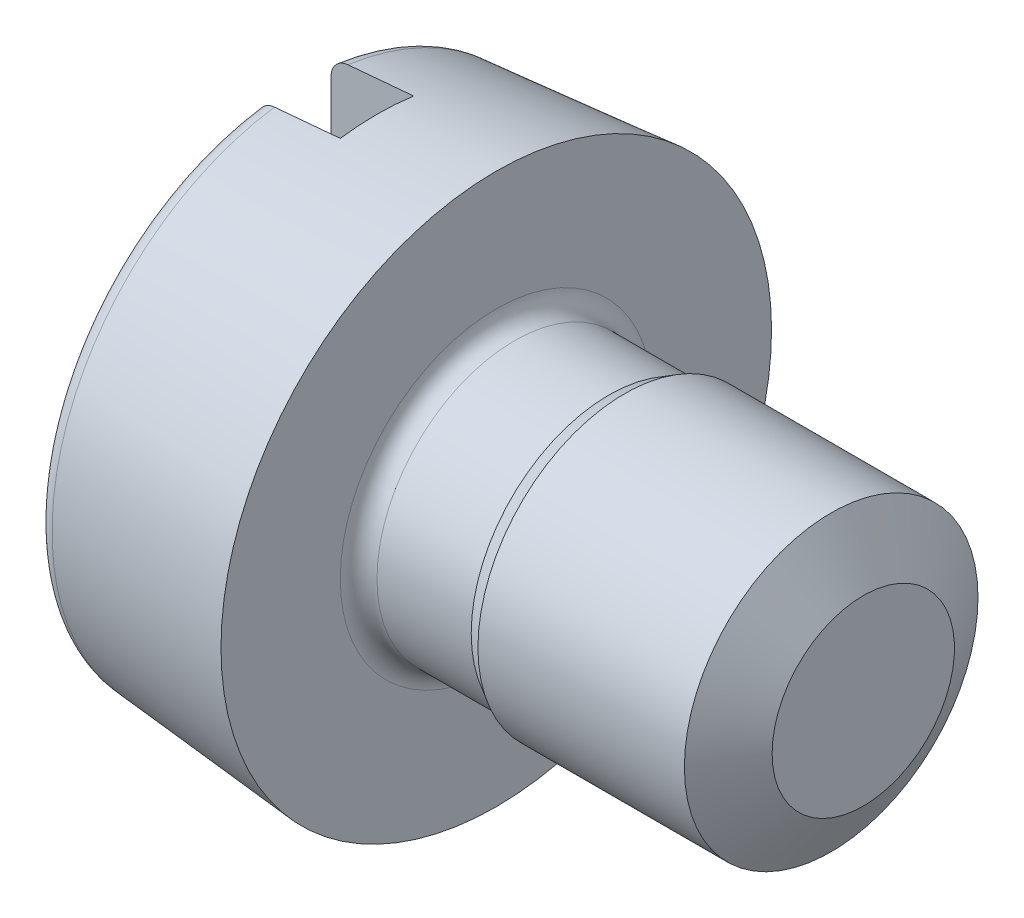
ISO-10303-21;
HEADER;
FILE_DESCRIPTION(('STEP AP214'),'2;1');
FILE_NAME('part.step','',(''),(''),'','','');
FILE_SCHEMA(('AUTOMOTIVE_DESIGN { 1 0 10303 214 1 1 1 1 }'));
ENDSEC;
DATA;
#1=APPLICATION_CONTEXT('core data for automotive mechanical design processes');
#2=APPLICATION_PROTOCOL_DEFINITION('international standard','automotive_design',2000,#1);
#3=PRODUCT_CONTEXT('',#1,'mechanical');
#4=PRODUCT('Part','Part','',(#3));
#5=PRODUCT_RELATED_PRODUCT_CATEGORY('part','',(#4));
#6=PRODUCT_DEFINITION_FORMATION('','',#4);
#7=PRODUCT_DEFINITION_CONTEXT('part definition',#1,'design');
#8=PRODUCT_DEFINITION('design','',#6,#7);
#9=PRODUCT_DEFINITION_SHAPE('','',#8);
#10=(LENGTH_UNIT() NAMED_UNIT(*) SI_UNIT(.MILLI.,.METRE.));
#11=(NAMED_UNIT(*) PLANE_ANGLE_UNIT() SI_UNIT($,.RADIAN.));
#12=(NAMED_UNIT(*) SI_UNIT($,.STERADIAN.) SOLID_ANGLE_UNIT());
#13=UNCERTAINTY_MEASURE_WITH_UNIT(LENGTH_MEASURE(1.E-05),#10,'distance_accuracy_value','');
#14=(GEOMETRIC_REPRESENTATION_CONTEXT(3) GLOBAL_UNCERTAINTY_ASSIGNED_CONTEXT((#13)) GLOBAL_UNIT_ASSIGNED_CONTEXT((#10,
#11,#12)) REPRESENTATION_CONTEXT('',''));
#15=CARTESIAN_POINT('',(0.,0.,0.));
#16=DIRECTION('',(0.,0.,1.));
#17=DIRECTION('',(1.,0.,0.));
#18=AXIS2_PLACEMENT_3D('',#15,#16,#17);
#19=CARTESIAN_POINT('',(0.,0.,0.));
#20=DIRECTION('',(-1.,0.,0.));
#21=DIRECTION('',(0.,0.,1.));
#22=AXIS2_PLACEMENT_3D('',#19,#20,#21);
#23=CYLINDRICAL_SURFACE('',#22,0.8);
#24=CARTESIAN_POINT('',(1.8,0.,0.));
#25=DIRECTION('',(-1.,0.,0.));
#26=DIRECTION('',(0.,0.,1.));
#27=AXIS2_PLACEMENT_3D('',#24,#25,#26);
#28=CIRCLE('',#27,0.8);
#29=CARTESIAN_POINT('',(1.8,0.,0.8));
#30=VERTEX_POINT('',#29);
#31=EDGE_CURVE('E246',#30,#30,#28,.T.);
#32=ORIENTED_EDGE('',*,*,#31,.F.);
#33=EDGE_LOOP('',(#32));
#34=FACE_BOUND('',#33,.T.);
#35=CARTESIAN_POINT('',(2.92500513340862,0.,0.));
#36=DIRECTION('',(-1.,0.,0.));
#37=DIRECTION('',(0.,0.,1.));
#38=AXIS2_PLACEMENT_3D('',#35,#36,#37);
#39=CIRCLE('',#38,0.8);
#40=CARTESIAN_POINT('',(2.92500513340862,0.,0.8));
#41=VERTEX_POINT('',#40);
#42=EDGE_CURVE('E169',#41,#41,#39,.T.);
#43=ORIENTED_EDGE('',*,*,#42,.T.);
#44=EDGE_LOOP('',(#43));
#45=FACE_BOUND('',#44,.T.);
#46=ADVANCED_FACE('F33',(#34,#45),#23,.T.);
#47=CARTESIAN_POINT('',(0.,0.,0.));
#48=DIRECTION('',(1.,0.,0.));
#49=DIRECTION('',(0.,0.,-1.));
#50=AXIS2_PLACEMENT_3D('',#47,#48,#49);
#51=PLANE('',#50);
#52=CARTESIAN_POINT('',(0.,0.,0.));
#53=DIRECTION('',(-1.,0.,0.));
#54=DIRECTION('',(0.,0.,1.));
#55=AXIS2_PLACEMENT_3D('',#52,#53,#54);
#56=CIRCLE('',#55,1.31212935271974);
#57=CARTESIAN_POINT('',(0.,-1.29679737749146,0.2));
#58=VERTEX_POINT('',#57);
#59=CARTESIAN_POINT('',(0.,1.29679737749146,0.2));
#60=VERTEX_POINT('',#59);
#61=EDGE_CURVE('E226',#58,#60,#56,.T.);
#62=ORIENTED_EDGE('',*,*,#61,.T.);
#63=DIRECTION('',(0.,1.,0.));
#64=VECTOR('',#63,1.);
#65=CARTESIAN_POINT('',(0.,1.48660687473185,0.2));
#66=LINE('',#65,#64);
#67=EDGE_CURVE('E161',#58,#60,#66,.T.);
#68=ORIENTED_EDGE('',*,*,#67,.F.);
#69=EDGE_LOOP('',(#62,#68));
#70=FACE_BOUND('',#69,.T.);
#71=ADVANCED_FACE('F184',(#70),#51,.F.);
#72=CARTESIAN_POINT('',(0.1,0.,0.));
#73=DIRECTION('',(-1.,0.,0.));
#74=DIRECTION('',(0.,0.,1.));
#75=AXIS2_PLACEMENT_3D('',#72,#73,#74);
#76=TOROIDAL_SURFACE('',#75,1.31212935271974,0.1);
#77=ORIENTED_EDGE('',*,*,#61,.F.);
#78=CARTESIAN_POINT('',(0.0386023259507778,-1.3766091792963,0.200000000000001));
#79=CARTESIAN_POINT('',(0.0429958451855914,-1.38006225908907,0.200000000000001));
#80=CARTESIAN_POINT('',(0.0476821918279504,-1.38314895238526,0.200000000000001));
#81=CARTESIAN_POINT('',(0.0575097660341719,-1.38849540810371,0.200000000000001));
#82=CARTESIAN_POINT('',(0.0626514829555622,-1.3907542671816,0.200000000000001));
#83=CARTESIAN_POINT('',(0.0732413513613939,-1.39437434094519,0.200000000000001));
#84=CARTESIAN_POINT('',(0.0786894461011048,-1.39573572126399,0.200000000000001));
#85=CARTESIAN_POINT('',(0.0897358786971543,-1.39751978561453,0.200000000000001));
#86=CARTESIAN_POINT('',(0.095334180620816,-1.39794269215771,0.200000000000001));
#87=CARTESIAN_POINT('',(0.106499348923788,-1.39783801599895,0.200000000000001));
#88=CARTESIAN_POINT('',(0.112066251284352,-1.39731424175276,0.200000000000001));
#89=CARTESIAN_POINT('',(0.123033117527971,-1.39533931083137,0.200000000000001));
#90=CARTESIAN_POINT('',(0.128433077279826,-1.3938881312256,0.200000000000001));
#91=CARTESIAN_POINT('',(0.138912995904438,-1.39010185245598,0.200000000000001));
#92=CARTESIAN_POINT('',(0.143992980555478,-1.38776682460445,0.200000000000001));
#93=CARTESIAN_POINT('',(0.153691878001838,-1.38228177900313,0.200000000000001));
#94=CARTESIAN_POINT('',(0.158310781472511,-1.37913174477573,0.200000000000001));
#95=CARTESIAN_POINT('',(0.166986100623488,-1.37208780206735,0.200000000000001));
#96=CARTESIAN_POINT('',(0.1710390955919,-1.3681896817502,0.200000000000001));
#97=CARTESIAN_POINT('',(0.178440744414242,-1.35977412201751,0.200000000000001));
#98=CARTESIAN_POINT('',(0.181789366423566,-1.3552566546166,0.200000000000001));
#99=CARTESIAN_POINT('',(0.18772216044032,-1.34568407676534,0.200000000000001));
#100=CARTESIAN_POINT('',(0.190298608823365,-1.34062417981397,0.200000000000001));
#101=CARTESIAN_POINT('',(0.194575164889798,-1.3301467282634,0.200000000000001));
#102=CARTESIAN_POINT('',(0.196275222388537,-1.32472915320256,0.2));
#103=CARTESIAN_POINT('',(0.198767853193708,-1.31363153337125,0.2));
#104=CARTESIAN_POINT('',(0.199551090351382,-1.30794939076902,0.2));
#105=CARTESIAN_POINT('',(0.200159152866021,-1.29653398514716,0.2));
#106=CARTESIAN_POINT('',(0.199983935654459,-1.29080071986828,0.2));
#107=CARTESIAN_POINT('',(0.198676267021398,-1.27940717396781,0.2));
#108=CARTESIAN_POINT('',(0.197537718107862,-1.27374759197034,0.2));
#109=CARTESIAN_POINT('',(0.194326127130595,-1.26269991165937,0.2));
#110=CARTESIAN_POINT('',(0.192253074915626,-1.25731181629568,0.2));
#111=CARTESIAN_POINT('',(0.187230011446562,-1.24696543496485,0.2));
#112=CARTESIAN_POINT('',(0.184280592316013,-1.24200686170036,0.2));
#113=CARTESIAN_POINT('',(0.177584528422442,-1.23266065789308,0.2));
#114=CARTESIAN_POINT('',(0.173837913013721,-1.22827300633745,0.2));
#115=CARTESIAN_POINT('',(0.165685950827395,-1.22023413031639,0.2));
#116=CARTESIAN_POINT('',(0.161286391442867,-1.21657703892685,0.2));
#117=CARTESIAN_POINT('',(0.151929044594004,-1.21006479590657,0.2));
#118=CARTESIAN_POINT('',(0.146971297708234,-1.20720958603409,0.2));
#119=CARTESIAN_POINT('',(0.136706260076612,-1.20242091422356,0.2));
#120=CARTESIAN_POINT('',(0.131404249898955,-1.20047613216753,0.2));
#121=CARTESIAN_POINT('',(0.120546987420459,-1.19751536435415,0.2));
#122=CARTESIAN_POINT('',(0.114991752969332,-1.19649931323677,0.2));
#123=CARTESIAN_POINT('',(0.10385037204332,-1.19543379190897,0.2));
#124=CARTESIAN_POINT('',(0.0982652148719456,-1.19537395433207,0.2));
#125=CARTESIAN_POINT('',(0.0871647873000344,-1.19619606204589,0.2));
#126=CARTESIAN_POINT('',(0.0816495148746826,-1.1970779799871,0.2));
#127=CARTESIAN_POINT('',(0.0708625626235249,-1.19975206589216,0.2));
#128=CARTESIAN_POINT('',(0.0655901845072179,-1.20154142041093,0.2));
#129=CARTESIAN_POINT('',(0.0554179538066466,-1.20597449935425,0.2));
#130=CARTESIAN_POINT('',(0.0505181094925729,-1.20861824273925,0.2));
#131=CARTESIAN_POINT('',(0.0411956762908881,-1.2147007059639,0.2));
#132=CARTESIAN_POINT('',(0.0367762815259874,-1.2181443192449,0.2));
#133=CARTESIAN_POINT('',(0.0285695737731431,-1.22571643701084,0.2));
#134=CARTESIAN_POINT('',(0.0247822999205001,-1.22984498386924,0.2));
#135=CARTESIAN_POINT('',(0.0178979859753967,-1.23872328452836,0.2));
#136=CARTESIAN_POINT('',(0.0148099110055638,-1.24347998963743,0.2));
#137=CARTESIAN_POINT('',(0.00946517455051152,-1.25343955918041,0.2));
#138=CARTESIAN_POINT('',(0.00720857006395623,-1.25864245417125,0.2));
#139=CARTESIAN_POINT('',(0.00356414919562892,-1.2694133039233,0.2));
#140=CARTESIAN_POINT('',(0.00218698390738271,-1.27498486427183,0.2));
#141=CARTESIAN_POINT('',(0.000381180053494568,-1.28627950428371,0.2));
#142=CARTESIAN_POINT('',(-4.74539005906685E-05,-1.29200258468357,0.2));
#143=CARTESIAN_POINT('',(5.61080152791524E-05,-1.30347499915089,0.2));
#144=CARTESIAN_POINT('',(0.000594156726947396,-1.30922428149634,0.2));
#145=CARTESIAN_POINT('',(0.00262960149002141,-1.32055218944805,0.2));
#146=CARTESIAN_POINT('',(0.00412723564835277,-1.3261307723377,0.200000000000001));
#147=CARTESIAN_POINT('',(0.00803985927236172,-1.33694859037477,0.200000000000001));
#148=CARTESIAN_POINT('',(0.0104537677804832,-1.3421882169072,0.200000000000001));
#149=CARTESIAN_POINT('',(0.0161325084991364,-1.35217847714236,0.200000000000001));
#150=CARTESIAN_POINT('',(0.0193962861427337,-1.35692970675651,0.200000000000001));
#151=CARTESIAN_POINT('',(0.0253460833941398,-1.36417911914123,0.200000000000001));
#152=CARTESIAN_POINT('',(0.0278065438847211,-1.36686558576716,0.200000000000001));
#153=CARTESIAN_POINT('',(0.033004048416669,-1.37195622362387,0.200000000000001));
#154=CARTESIAN_POINT('',(0.035741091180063,-1.3743603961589,0.200000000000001));
#155=CARTESIAN_POINT('',(0.0386023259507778,-1.3766091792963,0.200000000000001));
#156=B_SPLINE_CURVE_WITH_KNOTS('',3,(#78,#79,#80,#81,#82,#83,#84,#85,#86,#87,#88,#89,#90,#91,
#92,#93,#94,#95,#96,#97,#98,#99,#100,#101,#102,#103,#104,#105,#106,#107,#108,#109,#110,#111,
#112,#113,#114,#115,#116,#117,#118,#119,#120,#121,#122,#123,#124,#125,#126,#127,#128,#129,#130,
#131,#132,#133,#134,#135,#136,#137,#138,#139,#140,#141,#142,#143,#144,#145,#146,#147,#148,#149,
#150,#151,#152,#153,#154,#155),.UNSPECIFIED.,.T.,.F.,(4,2,2,2,2,2,2,2,2,2,2,2,2,2,2,2,2,2,2,2,2,
2,2,2,2,2,2,2,2,2,2,2,2,2,2,2,2,2,4),(0.,0.0167511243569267,0.0335204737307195,
0.0502867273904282,0.0670490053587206,0.0837439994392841,0.100439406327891,0.117133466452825,
0.133827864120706,0.150619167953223,0.167411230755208,0.184366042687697,0.20132182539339,
0.218448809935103,0.235576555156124,0.252813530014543,0.27005069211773,0.287276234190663,
0.304501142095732,0.321581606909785,0.338660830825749,0.355521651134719,0.372381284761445,
0.389057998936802,0.405734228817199,0.42235906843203,0.438984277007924,0.455714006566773,
0.472444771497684,0.489379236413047,0.506314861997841,0.523451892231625,0.540589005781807,
0.557830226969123,0.575075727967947,0.592300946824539,0.609504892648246,0.620413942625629,
0.631322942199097),.UNSPECIFIED.);
#157=CARTESIAN_POINT('',(0.091284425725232,-1.39751019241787,0.200000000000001));
#158=VERTEX_POINT('',#157);
#159=EDGE_CURVE('E141',#58,#158,#156,.T.);
#160=ORIENTED_EDGE('',*,*,#159,.T.);
#161=CARTESIAN_POINT('',(0.0912844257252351,0.,0.));
#162=DIRECTION('',(-1.,0.,0.));
#163=DIRECTION('',(0.,0.,1.));
#164=AXIS2_PLACEMENT_3D('',#161,#162,#163);
#165=CIRCLE('',#164,1.41174882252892);
#166=CARTESIAN_POINT('',(0.091284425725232,1.39751019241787,0.2));
#167=VERTEX_POINT('',#166);
#168=EDGE_CURVE('E108',#158,#167,#165,.T.);
#169=ORIENTED_EDGE('',*,*,#168,.T.);
#170=CARTESIAN_POINT('',(0.0539570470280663,1.20690058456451,0.2));
#171=CARTESIAN_POINT('',(0.0588759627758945,1.20431472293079,0.2));
#172=CARTESIAN_POINT('',(0.0640152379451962,1.20213990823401,0.2));
#173=CARTESIAN_POINT('',(0.0745897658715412,1.19868143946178,0.2));
#174=CARTESIAN_POINT('',(0.0800253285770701,1.19739873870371,0.2));
#175=CARTESIAN_POINT('',(0.0910341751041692,1.19576666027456,0.2));
#176=CARTESIAN_POINT('',(0.0966074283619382,1.19541707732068,0.2));
#177=CARTESIAN_POINT('',(0.107731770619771,1.19566186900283,0.2));
#178=CARTESIAN_POINT('',(0.113282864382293,1.19625602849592,0.2));
#179=CARTESIAN_POINT('',(0.124190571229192,1.19836634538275,0.2));
#180=CARTESIAN_POINT('',(0.12954768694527,1.19987990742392,0.2));
#181=CARTESIAN_POINT('',(0.139933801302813,1.20378066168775,0.2));
#182=CARTESIAN_POINT('',(0.144962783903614,1.20616789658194,0.2));
#183=CARTESIAN_POINT('',(0.154577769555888,1.21175839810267,0.2));
#184=CARTESIAN_POINT('',(0.159161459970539,1.21496564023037,0.2));
#185=CARTESIAN_POINT('',(0.167733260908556,1.2220958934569,0.2));
#186=CARTESIAN_POINT('',(0.171721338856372,1.22601894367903,0.2));
#187=CARTESIAN_POINT('',(0.179038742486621,1.23451784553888,0.2));
#188=CARTESIAN_POINT('',(0.182359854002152,1.23910076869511,0.2));
#189=CARTESIAN_POINT('',(0.188196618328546,1.24875359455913,0.2));
#190=CARTESIAN_POINT('',(0.190712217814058,1.2538235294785,0.2));
#191=CARTESIAN_POINT('',(0.194898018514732,1.26437375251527,0.2));
#192=CARTESIAN_POINT('',(0.196557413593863,1.26985832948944,0.2));
#193=CARTESIAN_POINT('',(0.198939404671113,1.28102734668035,0.2));
#194=CARTESIAN_POINT('',(0.199661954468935,1.28671179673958,0.2));
#195=CARTESIAN_POINT('',(0.200152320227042,1.29816346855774,0.2));
#196=CARTESIAN_POINT('',(0.199913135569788,1.3039309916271,0.2));
#197=CARTESIAN_POINT('',(0.198469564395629,1.31534409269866,0.2));
#198=CARTESIAN_POINT('',(0.19726516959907,1.32098966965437,0.2));
#199=CARTESIAN_POINT('',(0.193923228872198,1.33199489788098,0.2));
#200=CARTESIAN_POINT('',(0.191786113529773,1.33735467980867,0.2));
#201=CARTESIAN_POINT('',(0.186636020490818,1.34763565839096,0.2));
#202=CARTESIAN_POINT('',(0.183623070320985,1.35255686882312,0.2));
#203=CARTESIAN_POINT('',(0.17682888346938,1.36178205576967,0.2));
#204=CARTESIAN_POINT('',(0.173053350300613,1.36609023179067,0.2));
#205=CARTESIAN_POINT('',(0.164825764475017,1.37400331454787,0.2));
#206=CARTESIAN_POINT('',(0.160373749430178,1.37760826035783,0.2));
#207=CARTESIAN_POINT('',(0.150969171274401,1.38397267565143,0.2));
#208=CARTESIAN_POINT('',(0.146022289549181,1.3867405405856,0.2));
#209=CARTESIAN_POINT('',(0.135730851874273,1.39139748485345,0.2));
#210=CARTESIAN_POINT('',(0.130386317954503,1.39328661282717,0.2));
#211=CARTESIAN_POINT('',(0.119504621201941,1.39611535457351,0.2));
#212=CARTESIAN_POINT('',(0.11396970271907,1.39706360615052,0.2));
#213=CARTESIAN_POINT('',(0.102819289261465,1.39801247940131,0.2));
#214=CARTESIAN_POINT('',(0.0972037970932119,1.39801313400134,0.2));
#215=CARTESIAN_POINT('',(0.0860799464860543,1.39706912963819,0.2));
#216=CARTESIAN_POINT('',(0.0805712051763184,1.3961289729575,0.2));
#217=CARTESIAN_POINT('',(0.0697894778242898,1.39333829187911,0.2));
#218=CARTESIAN_POINT('',(0.0645164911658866,1.39148776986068,0.2));
#219=CARTESIAN_POINT('',(0.0543475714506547,1.38692828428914,0.2));
#220=CARTESIAN_POINT('',(0.0494521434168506,1.38421819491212,0.2));
#221=CARTESIAN_POINT('',(0.0401816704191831,1.37801995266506,0.2));
#222=CARTESIAN_POINT('',(0.0358066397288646,1.37453177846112,0.2));
#223=CARTESIAN_POINT('',(0.0276679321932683,1.36685164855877,0.2));
#224=CARTESIAN_POINT('',(0.0239086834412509,1.36265500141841,0.2));
#225=CARTESIAN_POINT('',(0.0171396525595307,1.35369558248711,0.2));
#226=CARTESIAN_POINT('',(0.0141299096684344,1.34893278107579,0.2));
#227=CARTESIAN_POINT('',(0.00891281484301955,1.33892482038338,0.2));
#228=CARTESIAN_POINT('',(0.0067138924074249,1.33367526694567,0.2));
#229=CARTESIAN_POINT('',(0.00321907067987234,1.32288372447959,0.2));
#230=CARTESIAN_POINT('',(0.00192322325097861,1.3173417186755,0.2));
#231=CARTESIAN_POINT('',(0.000259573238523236,1.30606539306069,0.2));
#232=CARTESIAN_POINT('',(-9.91593063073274E-05,1.3003297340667,0.2));
#233=CARTESIAN_POINT('',(0.000146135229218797,1.28887915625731,0.2));
#234=CARTESIAN_POINT('',(0.000750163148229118,1.28316423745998,0.2));
#235=CARTESIAN_POINT('',(0.0029096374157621,1.27188769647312,0.2));
#236=CARTESIAN_POINT('',(0.00446975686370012,1.26632696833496,0.2));
#237=CARTESIAN_POINT('',(0.00850410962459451,1.25554572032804,0.2));
#238=CARTESIAN_POINT('',(0.0109785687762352,1.25032528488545,0.2));
#239=CARTESIAN_POINT('',(0.0167681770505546,1.24038779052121,0.2));
#240=CARTESIAN_POINT('',(0.0200816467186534,1.23566975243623,0.2));
#241=CARTESIAN_POINT('',(0.0274587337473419,1.22686843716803,0.2));
#242=CARTESIAN_POINT('',(0.0315214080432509,1.22278437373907,0.2));
#243=CARTESIAN_POINT('',(0.0386764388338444,1.21672839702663,0.2));
#244=CARTESIAN_POINT('',(0.0415804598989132,1.21453019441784,0.2));
#245=CARTESIAN_POINT('',(0.047610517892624,1.2104627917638,0.2));
#246=CARTESIAN_POINT('',(0.0507365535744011,1.20859358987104,0.2));
#247=CARTESIAN_POINT('',(0.0539570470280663,1.20690058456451,0.2));
#248=B_SPLINE_CURVE_WITH_KNOTS('',3,(#170,#171,#172,#173,#174,#175,#176,#177,#178,#179,#180,
#181,#182,#183,#184,#185,#186,#187,#188,#189,#190,#191,#192,#193,#194,#195,#196,#197,#198,#199,
#200,#201,#202,#203,#204,#205,#206,#207,#208,#209,#210,#211,#212,#213,#214,#215,#216,#217,#218,
#219,#220,#221,#222,#223,#224,#225,#226,#227,#228,#229,#230,#231,#232,#233,#234,#235,#236,#237,
#238,#239,#240,#241,#242,#243,#244,#245,#246,#247),.UNSPECIFIED.,.T.,.F.,(4,2,2,2,2,2,2,2,2,2,2,
2,2,2,2,2,2,2,2,2,2,2,2,2,2,2,2,2,2,2,2,2,2,2,2,2,2,2,4),(0.,0.0166584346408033,
0.0333346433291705,0.0500071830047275,0.0666759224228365,0.0832978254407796,0.0999205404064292,
0.116625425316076,0.133331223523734,0.150231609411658,0.167133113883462,0.184243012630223,
0.201353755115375,0.218589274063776,0.23582494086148,0.253052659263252,0.270279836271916,
0.287382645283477,0.304484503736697,0.321408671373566,0.338331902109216,0.355098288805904,
0.371864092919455,0.388550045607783,0.405235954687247,0.421943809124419,0.438652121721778,
0.455475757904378,0.472300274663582,0.489295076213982,0.506290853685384,0.5234505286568,
0.540610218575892,0.557854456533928,0.575102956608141,0.592317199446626,0.609509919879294,
0.620416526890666,0.631323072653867),.UNSPECIFIED.);
#249=EDGE_CURVE('E136',#167,#60,#248,.T.);
#250=ORIENTED_EDGE('',*,*,#249,.T.);
#251=EDGE_LOOP('',(#77,#160,#169,#250));
#252=FACE_BOUND('',#251,.T.);
#253=ADVANCED_FACE('F153',(#252),#76,.T.);
#254=CARTESIAN_POINT('',(0.,1.29679737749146,-0.2));
#255=VERTEX_POINT('',#254);
#256=CARTESIAN_POINT('',(0.,-1.29679737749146,-0.2));
#257=VERTEX_POINT('',#256);
#258=EDGE_CURVE('E98',#255,#257,#56,.T.);
#259=ORIENTED_EDGE('',*,*,#258,.T.);
#260=DIRECTION('',(0.,-1.,0.));
#261=VECTOR('',#260,1.);
#262=CARTESIAN_POINT('',(0.,1.48660687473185,-0.2));
#263=LINE('',#262,#261);
#264=EDGE_CURVE('E163',#255,#257,#263,.T.);
#265=ORIENTED_EDGE('',*,*,#264,.F.);
#266=EDGE_LOOP('',(#259,#265));
#267=FACE_BOUND('',#266,.T.);
#268=ADVANCED_FACE('F35',(#267),#51,.F.);
#269=CARTESIAN_POINT('',(0.091284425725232,1.39751019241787,-0.2));
#270=VERTEX_POINT('',#269);
#271=CARTESIAN_POINT('',(0.091284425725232,-1.39751019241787,-0.2));
#272=VERTEX_POINT('',#271);
#273=EDGE_CURVE('E225',#270,#272,#165,.T.);
#274=ORIENTED_EDGE('',*,*,#273,.T.);
#275=CARTESIAN_POINT('',(0.0386023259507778,-1.3766091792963,-0.2));
#276=CARTESIAN_POINT('',(0.0341466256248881,-1.37310658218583,-0.2));
#277=CARTESIAN_POINT('',(0.0299856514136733,-1.36922193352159,-0.2));
#278=CARTESIAN_POINT('',(0.0223735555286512,-1.36080414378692,-0.2));
#279=CARTESIAN_POINT('',(0.0189233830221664,-1.35627014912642,-0.2));
#280=CARTESIAN_POINT('',(0.0128339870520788,-1.34669242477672,-0.2));
#281=CARTESIAN_POINT('',(0.0101940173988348,-1.34164916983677,-0.2));
#282=CARTESIAN_POINT('',(0.00579182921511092,-1.33119504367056,-0.2));
#283=CARTESIAN_POINT('',(0.00402939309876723,-1.32578426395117,-0.2));
#284=CARTESIAN_POINT('',(0.00141662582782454,-1.31470347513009,-0.2));
#285=CARTESIAN_POINT('',(0.000573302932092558,-1.30903181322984,-0.2));
#286=CARTESIAN_POINT('',(-0.000156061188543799,-1.29762695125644,-0.2));
#287=CARTESIAN_POINT('',(-4.20189515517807E-05,-1.29189374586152,-0.2));
#288=CARTESIAN_POINT('',(0.00114357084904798,-1.28048906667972,-0.2));
#289=CARTESIAN_POINT('',(0.00222138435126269,-1.27481824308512,-0.2));
#290=CARTESIAN_POINT('',(0.00531400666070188,-1.26373795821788,-0.2));
#291=CARTESIAN_POINT('',(0.00732882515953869,-1.25832849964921,-0.2));
#292=CARTESIAN_POINT('',(0.012240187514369,-1.24792837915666,-0.2));
#293=CARTESIAN_POINT('',(0.0151363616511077,-1.24293754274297,-0.2));
#294=CARTESIAN_POINT('',(0.0217319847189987,-1.2335181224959,-0.2));
#295=CARTESIAN_POINT('',(0.0254314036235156,-1.22908951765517,-0.2));
#296=CARTESIAN_POINT('',(0.0334977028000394,-1.22096056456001,-0.2));
#297=CARTESIAN_POINT('',(0.0378588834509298,-1.21725456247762,-0.2));
#298=CARTESIAN_POINT('',(0.0471483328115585,-1.21063862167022,-0.2));
#299=CARTESIAN_POINT('',(0.0520765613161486,-1.20772862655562,-0.2));
#300=CARTESIAN_POINT('',(0.0622929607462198,-1.20282674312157,-0.2));
#301=CARTESIAN_POINT('',(0.0675757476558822,-1.2008236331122,-0.2));
#302=CARTESIAN_POINT('',(0.078404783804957,-1.19774395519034,-0.2));
#303=CARTESIAN_POINT('',(0.0839510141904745,-1.19666732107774,-0.2));
#304=CARTESIAN_POINT('',(0.0950839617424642,-1.1954810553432,-0.2));
#305=CARTESIAN_POINT('',(0.100669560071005,-1.1953609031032,-0.2));
#306=CARTESIAN_POINT('',(0.11178098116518,-1.19606361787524,-0.2));
#307=CARTESIAN_POINT('',(0.117306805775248,-1.19688645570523,-0.2));
#308=CARTESIAN_POINT('',(0.128122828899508,-1.19944520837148,-0.2));
#309=CARTESIAN_POINT('',(0.133413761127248,-1.20117802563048,-0.2));
#310=CARTESIAN_POINT('',(0.143632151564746,-1.2055021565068,-0.2));
#311=CARTESIAN_POINT('',(0.148559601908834,-1.20809348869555,-0.2));
#312=CARTESIAN_POINT('',(0.157944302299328,-1.21407558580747,-0.2));
#313=CARTESIAN_POINT('',(0.162398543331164,-1.21747106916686,-0.2));
#314=CARTESIAN_POINT('',(0.170682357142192,-1.22495343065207,-0.2));
#315=CARTESIAN_POINT('',(0.174511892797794,-1.2290403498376,-0.2));
#316=CARTESIAN_POINT('',(0.181487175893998,-1.23784208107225,-0.2));
#317=CARTESIAN_POINT('',(0.184624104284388,-1.24256388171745,-0.2));
#318=CARTESIAN_POINT('',(0.190071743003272,-1.25246217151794,-0.2));
#319=CARTESIAN_POINT('',(0.192382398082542,-1.25763869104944,-0.2));
#320=CARTESIAN_POINT('',(0.196139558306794,-1.26836622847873,-0.2));
#321=CARTESIAN_POINT('',(0.197575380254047,-1.27392098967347,-0.2));
#322=CARTESIAN_POINT('',(0.199500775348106,-1.28519223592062,-0.2));
#323=CARTESIAN_POINT('',(0.199990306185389,-1.29090872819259,-0.2));
#324=CARTESIAN_POINT('',(0.200009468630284,-1.30238020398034,-0.2));
#325=CARTESIAN_POINT('',(0.199532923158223,-1.30813519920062,-0.2));
#326=CARTESIAN_POINT('',(0.19761914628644,-1.31948331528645,-0.2));
#327=CARTESIAN_POINT('',(0.196181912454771,-1.32507643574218,-0.2));
#328=CARTESIAN_POINT('',(0.192387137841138,-1.33593260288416,-0.2));
#329=CARTESIAN_POINT('',(0.190030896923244,-1.34119610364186,-0.2));
#330=CARTESIAN_POINT('',(0.18446144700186,-1.35124848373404,-0.2));
#331=CARTESIAN_POINT('',(0.181248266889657,-1.35603737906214,-0.2));
#332=CARTESIAN_POINT('',(0.174082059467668,-1.36496360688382,-0.2));
#333=CARTESIAN_POINT('',(0.170135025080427,-1.36910574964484,-0.2));
#334=CARTESIAN_POINT('',(0.161595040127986,-1.37665998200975,-0.2));
#335=CARTESIAN_POINT('',(0.157002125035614,-1.38007211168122,-0.2));
#336=CARTESIAN_POINT('',(0.147352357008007,-1.38603163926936,-0.2));
#337=CARTESIAN_POINT('',(0.142300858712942,-1.38858770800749,-0.2));
#338=CARTESIAN_POINT('',(0.131837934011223,-1.39280665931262,-0.2));
#339=CARTESIAN_POINT('',(0.126426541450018,-1.39446962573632,-0.2));
#340=CARTESIAN_POINT('',(0.115449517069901,-1.39684122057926,-0.2));
#341=CARTESIAN_POINT('',(0.109885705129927,-1.39755827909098,-0.2));
#342=CARTESIAN_POINT('',(0.0987153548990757,-1.39804400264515,-0.2));
#343=CARTESIAN_POINT('',(0.0931088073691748,-1.39781245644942,-0.2));
#344=CARTESIAN_POINT('',(0.0820354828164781,-1.39641041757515,-0.2));
#345=CARTESIAN_POINT('',(0.0765682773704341,-1.39524328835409,-0.2));
#346=CARTESIAN_POINT('',(0.0659117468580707,-1.39200973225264,-0.2));
#347=CARTESIAN_POINT('',(0.0607220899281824,-1.38994440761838,-0.2));
#348=CARTESIAN_POINT('',(0.0527121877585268,-1.38595102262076,-0.2));
#349=CARTESIAN_POINT('',(0.0497584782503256,-1.38428466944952,-0.2));
#350=CARTESIAN_POINT('',(0.0440355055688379,-1.38066079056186,-0.2));
#351=CARTESIAN_POINT('',(0.0412662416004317,-1.37870326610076,-0.2));
#352=CARTESIAN_POINT('',(0.0386023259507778,-1.3766091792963,-0.2));
#353=B_SPLINE_CURVE_WITH_KNOTS('',3,(#275,#276,#277,#278,#279,#280,#281,#282,#283,#284,#285,
#286,#287,#288,#289,#290,#291,#292,#293,#294,#295,#296,#297,#298,#299,#300,#301,#302,#303,#304,
#305,#306,#307,#308,#309,#310,#311,#312,#313,#314,#315,#316,#317,#318,#319,#320,#321,#322,#323,
#324,#325,#326,#327,#328,#329,#330,#331,#332,#333,#334,#335,#336,#337,#338,#339,#340,#341,#342,
#343,#344,#345,#346,#347,#348,#349,#350,#351,#352),.UNSPECIFIED.,.T.,.F.,(4,2,2,2,2,2,2,2,2,2,2,
2,2,2,2,2,2,2,2,2,2,2,2,2,2,2,2,2,2,2,2,2,2,2,2,2,2,2,4),(0.,0.0169902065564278,
0.034002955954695,0.0509999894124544,0.0679928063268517,0.0851143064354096,0.10223729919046,
0.119472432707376,0.136707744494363,0.15393583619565,0.171163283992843,0.188249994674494,
0.205335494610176,0.222203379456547,0.239070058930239,0.255750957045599,0.272431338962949,
0.289055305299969,0.305679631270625,0.322404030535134,0.339129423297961,0.356056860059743,
0.372985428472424,0.39011678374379,0.407248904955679,0.424490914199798,0.441732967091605,
0.458950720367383,0.476167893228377,0.493250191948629,0.510331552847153,0.527234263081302,
0.544135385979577,0.560884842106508,0.577638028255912,0.594331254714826,0.611004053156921,
0.621161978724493,0.631319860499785),.UNSPECIFIED.);
#354=EDGE_CURVE('E142',#272,#257,#353,.T.);
#355=ORIENTED_EDGE('',*,*,#354,.T.);
#356=ORIENTED_EDGE('',*,*,#258,.F.);
#357=CARTESIAN_POINT('',(0.0539570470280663,1.20690058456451,-0.2));
#358=CARTESIAN_POINT('',(0.048958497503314,1.20952888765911,-0.2));
#359=CARTESIAN_POINT('',(0.0441802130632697,1.21258560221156,-0.2));
#360=CARTESIAN_POINT('',(0.0352028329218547,1.21946309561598,-0.2));
#361=CARTESIAN_POINT('',(0.031004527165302,1.22328489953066,-0.2));
#362=CARTESIAN_POINT('',(0.0233108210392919,1.23157336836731,-0.2));
#363=CARTESIAN_POINT('',(0.0198147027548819,1.23603936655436,-0.2));
#364=CARTESIAN_POINT('',(0.0136147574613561,1.24548893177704,-0.2));
#365=CARTESIAN_POINT('',(0.0109107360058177,1.25047237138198,-0.2));
#366=CARTESIAN_POINT('',(0.00634315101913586,1.26086618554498,-0.2));
#367=CARTESIAN_POINT('',(0.00448765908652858,1.26628010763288,-0.2));
#368=CARTESIAN_POINT('',(0.00170360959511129,1.27734156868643,-0.2));
#369=CARTESIAN_POINT('',(0.000775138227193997,1.28298912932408,-0.2));
#370=CARTESIAN_POINT('',(-0.000133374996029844,1.29440593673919,-0.2));
#371=CARTESIAN_POINT('',(-0.000105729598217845,1.3001757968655,-0.2));
#372=CARTESIAN_POINT('',(0.000917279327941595,1.3116292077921,-0.2));
#373=CARTESIAN_POINT('',(0.00191265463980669,1.31731275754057,-0.2));
#374=CARTESIAN_POINT('',(0.004846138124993,1.32843377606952,-0.2));
#375=CARTESIAN_POINT('',(0.00678462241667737,1.33387114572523,-0.2));
#376=CARTESIAN_POINT('',(0.0115528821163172,1.34434007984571,-0.2));
#377=CARTESIAN_POINT('',(0.0143826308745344,1.34937165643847,-0.2));
#378=CARTESIAN_POINT('',(0.0208344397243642,1.35884951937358,-0.2));
#379=CARTESIAN_POINT('',(0.0244511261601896,1.36329946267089,-0.2));
#380=CARTESIAN_POINT('',(0.0323872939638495,1.37152111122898,-0.2));
#381=CARTESIAN_POINT('',(0.0367067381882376,1.37529285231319,-0.2));
#382=CARTESIAN_POINT('',(0.0458783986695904,1.3820096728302,-0.2));
#383=CARTESIAN_POINT('',(0.0507246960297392,1.38496283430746,-0.2));
#384=CARTESIAN_POINT('',(0.0608479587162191,1.39000445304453,-0.2));
#385=CARTESIAN_POINT('',(0.0661248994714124,1.39209295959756,-0.2));
#386=CARTESIAN_POINT('',(0.076905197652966,1.39532607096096,-0.2));
#387=CARTESIAN_POINT('',(0.0824059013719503,1.39647952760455,-0.2));
#388=CARTESIAN_POINT('',(0.0935230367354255,1.39784103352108,-0.2));
#389=CARTESIAN_POINT('',(0.0991394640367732,1.39804911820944,-0.2));
#390=CARTESIAN_POINT('',(0.110296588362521,1.39751509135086,-0.2));
#391=CARTESIAN_POINT('',(0.115837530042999,1.39677807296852,-0.2));
#392=CARTESIAN_POINT('',(0.126717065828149,1.39438474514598,-0.2));
#393=CARTESIAN_POINT('',(0.132055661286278,1.39272844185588,-0.2));
#394=CARTESIAN_POINT('',(0.14238353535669,1.38854450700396,-0.2));
#395=CARTESIAN_POINT('',(0.147372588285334,1.38601631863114,-0.2));
#396=CARTESIAN_POINT('',(0.15685901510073,1.38016329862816,-0.2));
#397=CARTESIAN_POINT('',(0.161356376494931,1.37683844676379,-0.2));
#398=CARTESIAN_POINT('',(0.169763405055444,1.3694649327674,-0.2));
#399=CARTESIAN_POINT('',(0.173669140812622,1.36541178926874,-0.2));
#400=CARTESIAN_POINT('',(0.180752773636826,1.35671294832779,-0.2));
#401=CARTESIAN_POINT('',(0.183930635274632,1.35206722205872,-0.2));
#402=CARTESIAN_POINT('',(0.18950216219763,1.34226591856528,-0.2));
#403=CARTESIAN_POINT('',(0.191887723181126,1.33710573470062,-0.2));
#404=CARTESIAN_POINT('',(0.195768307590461,1.32646075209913,-0.2));
#405=CARTESIAN_POINT('',(0.197263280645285,1.32097593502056,-0.2));
#406=CARTESIAN_POINT('',(0.199334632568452,1.30977932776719,-0.2));
#407=CARTESIAN_POINT('',(0.199901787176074,1.30406583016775,-0.2));
#408=CARTESIAN_POINT('',(0.200074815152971,1.29262422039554,-0.2));
#409=CARTESIAN_POINT('',(0.199680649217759,1.28689610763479,-0.2));
#410=CARTESIAN_POINT('',(0.197937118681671,1.27555345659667,-0.2));
#411=CARTESIAN_POINT('',(0.19658231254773,1.26993975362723,-0.2));
#412=CARTESIAN_POINT('',(0.192948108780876,1.25901986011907,-0.2));
#413=CARTESIAN_POINT('',(0.190668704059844,1.25371367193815,-0.2));
#414=CARTESIAN_POINT('',(0.185251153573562,1.24357003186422,-0.2));
#415=CARTESIAN_POINT('',(0.182114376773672,1.23873184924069,-0.2));
#416=CARTESIAN_POINT('',(0.175066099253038,1.22965695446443,-0.2));
#417=CARTESIAN_POINT('',(0.171154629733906,1.22542021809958,-0.2));
#418=CARTESIAN_POINT('',(0.162704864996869,1.2177112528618,-0.2));
#419=CARTESIAN_POINT('',(0.158172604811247,1.21423241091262,-0.2));
#420=CARTESIAN_POINT('',(0.148582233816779,1.20809694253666,-0.2));
#421=CARTESIAN_POINT('',(0.143524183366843,1.20544022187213,-0.2));
#422=CARTESIAN_POINT('',(0.133096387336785,1.2010605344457,-0.2));
#423=CARTESIAN_POINT('',(0.1277315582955,1.19932585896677,-0.2));
#424=CARTESIAN_POINT('',(0.116783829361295,1.19679190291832,-0.2));
#425=CARTESIAN_POINT('',(0.111200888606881,1.1959927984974,-0.2));
#426=CARTESIAN_POINT('',(0.10003574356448,1.19535870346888,-0.2));
#427=CARTESIAN_POINT('',(0.094454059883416,1.19551441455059,-0.2));
#428=CARTESIAN_POINT('',(0.083401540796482,1.19676359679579,-0.2));
#429=CARTESIAN_POINT('',(0.0779305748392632,1.19785588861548,-0.2));
#430=CARTESIAN_POINT('',(0.0693704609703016,1.20032851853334,-0.2));
#431=CARTESIAN_POINT('',(0.066196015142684,1.20142352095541,-0.2));
#432=CARTESIAN_POINT('',(0.059974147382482,1.20392880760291,-0.2));
#433=CARTESIAN_POINT('',(0.0569267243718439,1.20533908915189,-0.2));
#434=CARTESIAN_POINT('',(0.0539570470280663,1.20690058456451,-0.2));
#435=B_SPLINE_CURVE_WITH_KNOTS('',3,(#357,#358,#359,#360,#361,#362,#363,#364,#365,#366,#367,
#368,#369,#370,#371,#372,#373,#374,#375,#376,#377,#378,#379,#380,#381,#382,#383,#384,#385,#386,
#387,#388,#389,#390,#391,#392,#393,#394,#395,#396,#397,#398,#399,#400,#401,#402,#403,#404,#405,
#406,#407,#408,#409,#410,#411,#412,#413,#414,#415,#416,#417,#418,#419,#420,#421,#422,#423,#424,
#425,#426,#427,#428,#429,#430,#431,#432,#433,#434),.UNSPECIFIED.,.T.,.F.,(4,2,2,2,2,2,2,2,2,2,2,
2,2,2,2,2,2,2,2,2,2,2,2,2,2,2,2,2,2,2,2,2,2,2,2,2,2,2,4),(0.,0.0169298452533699,
0.0338825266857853,0.0508177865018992,0.067748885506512,0.0848378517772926,0.1019284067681,
0.119156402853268,0.136384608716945,0.153619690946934,0.170854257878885,0.187974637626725,
0.205094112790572,0.222037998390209,0.238980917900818,0.255761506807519,0.272541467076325,
0.289231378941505,0.305921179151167,0.322621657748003,0.339322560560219,0.35612998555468,
0.372938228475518,0.389913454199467,0.406889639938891,0.424033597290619,0.44117825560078,
0.458420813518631,0.475663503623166,0.492878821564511,0.510093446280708,0.527151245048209,
0.544207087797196,0.561040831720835,0.577877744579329,0.594550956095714,0.61120320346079,
0.621261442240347,0.631319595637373),.UNSPECIFIED.);
#436=EDGE_CURVE('E102',#255,#270,#435,.T.);
#437=ORIENTED_EDGE('',*,*,#436,.T.);
#438=EDGE_LOOP('',(#274,#355,#356,#437));
#439=FACE_BOUND('',#438,.T.);
#440=ADVANCED_FACE('F149',(#439),#76,.T.);
#441=CARTESIAN_POINT('',(1.1,0.,0.));
#442=DIRECTION('',(1.,0.,0.));
#443=DIRECTION('',(0.,0.,-1.));
#444=AXIS2_PLACEMENT_3D('',#441,#442,#443);
#445=CONICAL_SURFACE('',#444,1.5,0.0872664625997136);
#446=CARTESIAN_POINT('',(0.45,0.,0.));
#447=DIRECTION('',(-1.,0.,0.));
#448=DIRECTION('',(0.,-1.,0.));
#449=AXIS2_PLACEMENT_3D('',#446,#447,#448);
#450=CIRCLE('',#449,1.44313236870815);
#451=CARTESIAN_POINT('',(0.45,1.42920643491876,0.2));
#452=VERTEX_POINT('',#451);
#453=CARTESIAN_POINT('',(0.45,1.42920643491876,-0.2));
#454=VERTEX_POINT('',#453);
#455=EDGE_CURVE('E100',#452,#454,#450,.T.);
#456=ORIENTED_EDGE('',*,*,#455,.F.);
#457=CARTESIAN_POINT('',(2.85595770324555,1.64148720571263,0.2));
#458=CARTESIAN_POINT('',(2.42068261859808,1.60312345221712,0.2));
#459=CARTESIAN_POINT('',(1.98540916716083,1.5647411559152,0.2));
#460=CARTESIAN_POINT('',(1.11486658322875,1.48792772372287,0.2));
#461=CARTESIAN_POINT('',(0.679597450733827,1.4494965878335,0.2));
#462=CARTESIAN_POINT('',(-0.190935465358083,1.37257372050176,0.2));
#463=CARTESIAN_POINT('',(-0.62619924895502,1.33408198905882,0.2));
#464=CARTESIAN_POINT('',(-1.49671973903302,1.25701848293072,0.2));
#465=CARTESIAN_POINT('',(-1.93197644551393,1.21844670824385,0.2));
#466=CARTESIAN_POINT('',(-2.36722874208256,1.17982518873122,0.2));
#467=B_SPLINE_CURVE_WITH_KNOTS('',3,(#457,#458,#459,#460,#461,#462,#463,#464,#465,#466),
.UNSPECIFIED.,.F.,.F.,(4,2,2,2,4),(0.,1.31088733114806,2.62177463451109,3.93266195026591,
5.24354929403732),.UNSPECIFIED.);
#468=EDGE_CURVE('E11',#452,#167,#467,.T.);
#469=ORIENTED_EDGE('',*,*,#468,.T.);
#470=ORIENTED_EDGE('',*,*,#168,.F.);
#471=CARTESIAN_POINT('',(-2.36722874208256,-1.17982518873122,0.2));
#472=CARTESIAN_POINT('',(-1.63628534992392,-1.24468082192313,0.200000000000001));
#473=CARTESIAN_POINT('',(-0.905330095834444,-1.30940250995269,0.200000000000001));
#474=CARTESIAN_POINT('',(-0.0348008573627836,-1.38636709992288,0.200000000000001));
#475=CARTESIAN_POINT('',(0.104764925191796,-1.39870275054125,0.200000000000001));
#476=CARTESIAN_POINT('',(1.11486395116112,-1.48795760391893,0.200000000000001));
#477=CARTESIAN_POINT('',(1.98540807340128,-1.56475373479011,0.200000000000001));
#478=CARTESIAN_POINT('',(2.85595770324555,-1.64148720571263,0.200000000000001));
#479=B_SPLINE_CURVE_WITH_KNOTS('',3,(#471,#472,#473,#474,#475,#476,#477,#478),.UNSPECIFIED.,.F.,
.F.,(4,2,2,4),(0.,2.20144504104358,2.62177465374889,5.24354928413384),.UNSPECIFIED.);
#480=CARTESIAN_POINT('',(0.45,-1.42920643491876,0.200000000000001));
#481=VERTEX_POINT('',#480);
#482=EDGE_CURVE('E61',#158,#481,#479,.T.);
#483=ORIENTED_EDGE('',*,*,#482,.T.);
#484=CARTESIAN_POINT('',(0.45,-1.42920643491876,-0.2));
#485=VERTEX_POINT('',#484);
#486=EDGE_CURVE('E91',#485,#481,#450,.T.);
#487=ORIENTED_EDGE('',*,*,#486,.F.);
#488=CARTESIAN_POINT('',(2.85595770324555,-1.64148720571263,-0.2));
#489=CARTESIAN_POINT('',(2.42068261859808,-1.60312345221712,-0.2));
#490=CARTESIAN_POINT('',(1.98540916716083,-1.5647411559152,-0.2));
#491=CARTESIAN_POINT('',(1.11486658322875,-1.48792772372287,-0.2));
#492=CARTESIAN_POINT('',(0.679597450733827,-1.4494965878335,-0.2));
#493=CARTESIAN_POINT('',(-0.190935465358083,-1.37257372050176,-0.2));
#494=CARTESIAN_POINT('',(-0.62619924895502,-1.33408198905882,-0.2));
#495=CARTESIAN_POINT('',(-1.49671973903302,-1.25701848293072,-0.2));
#496=CARTESIAN_POINT('',(-1.93197644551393,-1.21844670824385,-0.2));
#497=CARTESIAN_POINT('',(-2.36722874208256,-1.17982518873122,-0.2));
#498=B_SPLINE_CURVE_WITH_KNOTS('',3,(#488,#489,#490,#491,#492,#493,#494,#495,#496,#497),
.UNSPECIFIED.,.F.,.F.,(4,2,2,2,4),(0.,1.31088733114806,2.62177463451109,3.93266195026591,
5.24354929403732),.UNSPECIFIED.);
#499=EDGE_CURVE('E97',#485,#272,#498,.T.);
#500=ORIENTED_EDGE('',*,*,#499,.T.);
#501=ORIENTED_EDGE('',*,*,#273,.F.);
#502=CARTESIAN_POINT('',(-2.36722874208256,1.17982518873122,-0.2));
#503=CARTESIAN_POINT('',(-1.63628534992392,1.24468082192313,-0.2));
#504=CARTESIAN_POINT('',(-0.905330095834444,1.30940250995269,-0.2));
#505=CARTESIAN_POINT('',(-0.0348008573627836,1.38636709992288,-0.2));
#506=CARTESIAN_POINT('',(0.104764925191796,1.39870275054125,-0.2));
#507=CARTESIAN_POINT('',(1.11486395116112,1.48795760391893,-0.2));
#508=CARTESIAN_POINT('',(1.98540807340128,1.56475373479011,-0.2));
#509=CARTESIAN_POINT('',(2.85595770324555,1.64148720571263,-0.2));
#510=B_SPLINE_CURVE_WITH_KNOTS('',3,(#502,#503,#504,#505,#506,#507,#508,#509),.UNSPECIFIED.,.F.,
.F.,(4,2,2,4),(0.,2.20144504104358,2.62177465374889,5.24354928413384),.UNSPECIFIED.);
#511=EDGE_CURVE('E46',#270,#454,#510,.T.);
#512=ORIENTED_EDGE('',*,*,#511,.T.);
#513=EDGE_LOOP('',(#456,#469,#470,#483,#487,#500,#501,#512));
#514=FACE_BOUND('',#513,.T.);
#515=CARTESIAN_POINT('',(1.1,0.,0.));
#516=DIRECTION('',(-1.,0.,0.));
#517=DIRECTION('',(0.,0.,1.));
#518=AXIS2_PLACEMENT_3D('',#515,#516,#517);
#519=CIRCLE('',#518,1.5);
#520=CARTESIAN_POINT('',(1.1,0.,1.5));
#521=VERTEX_POINT('',#520);
#522=EDGE_CURVE('E212',#521,#521,#519,.T.);
#523=ORIENTED_EDGE('',*,*,#522,.T.);
#524=EDGE_LOOP('',(#523));
#525=FACE_BOUND('',#524,.T.);
#526=ADVANCED_FACE('F105',(#514,#525),#445,.T.);
#527=CARTESIAN_POINT('',(1.1,1.5,0.));
#528=DIRECTION('',(-1.,0.,0.));
#529=DIRECTION('',(0.,0.,1.));
#530=AXIS2_PLACEMENT_3D('',#527,#528,#529);
#531=PLANE('',#530);
#532=ORIENTED_EDGE('',*,*,#522,.F.);
#533=EDGE_LOOP('',(#532));
#534=FACE_BOUND('',#533,.T.);
#535=CARTESIAN_POINT('',(1.1,0.,0.));
#536=DIRECTION('',(-1.,0.,0.));
#537=DIRECTION('',(0.,0.,1.));
#538=AXIS2_PLACEMENT_3D('',#535,#536,#537);
#539=CIRCLE('',#538,0.85);
#540=CARTESIAN_POINT('',(1.1,0.,0.85));
#541=VERTEX_POINT('',#540);
#542=EDGE_CURVE('E215',#541,#541,#539,.T.);
#543=ORIENTED_EDGE('',*,*,#542,.T.);
#544=EDGE_LOOP('',(#543));
#545=FACE_BOUND('',#544,.T.);
#546=ADVANCED_FACE('F202',(#534,#545),#531,.F.);
#547=CARTESIAN_POINT('',(1.2,0.,0.));
#548=DIRECTION('',(-1.,0.,0.));
#549=DIRECTION('',(0.,0.,1.));
#550=AXIS2_PLACEMENT_3D('',#547,#548,#549);
#551=TOROIDAL_SURFACE('',#550,0.85,0.1);
#552=ORIENTED_EDGE('',*,*,#542,.F.);
#553=EDGE_LOOP('',(#552));
#554=FACE_BOUND('',#553,.T.);
#555=CARTESIAN_POINT('',(1.2,0.,0.));
#556=DIRECTION('',(-1.,0.,0.));
#557=DIRECTION('',(0.,0.,1.));
#558=AXIS2_PLACEMENT_3D('',#555,#556,#557);
#559=CIRCLE('',#558,0.75);
#560=CARTESIAN_POINT('',(1.2,0.,0.75));
#561=VERTEX_POINT('',#560);
#562=EDGE_CURVE('E216',#561,#561,#559,.T.);
#563=ORIENTED_EDGE('',*,*,#562,.T.);
#564=EDGE_LOOP('',(#563));
#565=FACE_BOUND('',#564,.T.);
#566=ADVANCED_FACE('F199',(#554,#565),#551,.F.);
#567=CARTESIAN_POINT('',(0.,0.,0.));
#568=DIRECTION('',(-1.,0.,0.));
#569=DIRECTION('',(0.,0.,1.));
#570=AXIS2_PLACEMENT_3D('',#567,#568,#569);
#571=CYLINDRICAL_SURFACE('',#570,0.75);
#572=ORIENTED_EDGE('',*,*,#562,.F.);
#573=EDGE_LOOP('',(#572));
#574=FACE_BOUND('',#573,.T.);
#575=CARTESIAN_POINT('',(1.71339745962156,0.,0.));
#576=DIRECTION('',(-1.,0.,0.));
#577=DIRECTION('',(0.,0.,1.));
#578=AXIS2_PLACEMENT_3D('',#575,#576,#577);
#579=CIRCLE('',#578,0.75);
#580=CARTESIAN_POINT('',(1.71339745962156,0.,0.75));
#581=VERTEX_POINT('',#580);
#582=EDGE_CURVE('E220',#581,#581,#579,.T.);
#583=ORIENTED_EDGE('',*,*,#582,.T.);
#584=EDGE_LOOP('',(#583));
#585=FACE_BOUND('',#584,.T.);
#586=ADVANCED_FACE('F195',(#574,#585),#571,.T.);
#587=CARTESIAN_POINT('',(1.8,0.,0.));
#588=DIRECTION('',(1.,0.,0.));
#589=DIRECTION('',(0.,0.,-1.));
#590=AXIS2_PLACEMENT_3D('',#587,#588,#589);
#591=CONICAL_SURFACE('',#590,0.8,0.5235987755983);
#592=ORIENTED_EDGE('',*,*,#582,.F.);
#593=EDGE_LOOP('',(#592));
#594=FACE_BOUND('',#593,.T.);
#595=ORIENTED_EDGE('',*,*,#31,.T.);
#596=EDGE_LOOP('',(#595));
#597=FACE_BOUND('',#596,.T.);
#598=ADVANCED_FACE('F127',(#594,#597),#591,.T.);
#599=CARTESIAN_POINT('',(0.45,1.48660687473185,0.2));
#600=DIRECTION('',(0.,0.,1.));
#601=DIRECTION('',(0.,-1.,0.));
#602=AXIS2_PLACEMENT_3D('',#599,#600,#601);
#603=PLANE('',#602);
#604=ORIENTED_EDGE('',*,*,#67,.T.);
#605=ORIENTED_EDGE('',*,*,#249,.F.);
#606=ORIENTED_EDGE('',*,*,#468,.F.);
#607=DIRECTION('',(0.,1.,0.));
#608=VECTOR('',#607,1.);
#609=CARTESIAN_POINT('',(0.45,1.48660687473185,0.2));
#610=LINE('',#609,#608);
#611=EDGE_CURVE('E93',#481,#452,#610,.T.);
#612=ORIENTED_EDGE('',*,*,#611,.F.);
#613=ORIENTED_EDGE('',*,*,#482,.F.);
#614=ORIENTED_EDGE('',*,*,#159,.F.);
#615=EDGE_LOOP('',(#604,#605,#606,#612,#613,#614));
#616=FACE_BOUND('',#615,.T.);
#617=ADVANCED_FACE('F101',(#616),#603,.F.);
#618=CARTESIAN_POINT('',(0.45,1.48660687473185,-0.2));
#619=DIRECTION('',(0.,0.,-1.));
#620=DIRECTION('',(-1.,0.,0.));
#621=AXIS2_PLACEMENT_3D('',#618,#619,#620);
#622=PLANE('',#621);
#623=ORIENTED_EDGE('',*,*,#499,.F.);
#624=DIRECTION('',(0.,-1.,0.));
#625=VECTOR('',#624,1.);
#626=CARTESIAN_POINT('',(0.45,1.48660687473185,-0.2));
#627=LINE('',#626,#625);
#628=EDGE_CURVE('E53',#454,#485,#627,.T.);
#629=ORIENTED_EDGE('',*,*,#628,.F.);
#630=ORIENTED_EDGE('',*,*,#511,.F.);
#631=ORIENTED_EDGE('',*,*,#436,.F.);
#632=ORIENTED_EDGE('',*,*,#264,.T.);
#633=ORIENTED_EDGE('',*,*,#354,.F.);
#634=EDGE_LOOP('',(#623,#629,#630,#631,#632,#633));
#635=FACE_BOUND('',#634,.T.);
#636=ADVANCED_FACE('F126',(#635),#622,.F.);
#637=CARTESIAN_POINT('',(0.45,0.,0.));
#638=DIRECTION('',(-1.,0.,0.));
#639=DIRECTION('',(0.,-1.,0.));
#640=AXIS2_PLACEMENT_3D('',#637,#638,#639);
#641=PLANE('',#640);
#642=ORIENTED_EDGE('',*,*,#455,.T.);
#643=ORIENTED_EDGE('',*,*,#628,.T.);
#644=ORIENTED_EDGE('',*,*,#486,.T.);
#645=ORIENTED_EDGE('',*,*,#611,.T.);
#646=EDGE_LOOP('',(#642,#643,#644,#645));
#647=FACE_BOUND('',#646,.T.);
#648=ADVANCED_FACE('F92',(#647),#641,.T.);
#649=CARTESIAN_POINT('',(2.92500513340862,0.,0.));
#650=DIRECTION('',(-1.,0.,0.));
#651=DIRECTION('',(0.,0.,1.));
#652=AXIS2_PLACEMENT_3D('',#649,#650,#651);
#653=CONICAL_SURFACE('',#652,0.8,1.04719755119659);
#654=CARTESIAN_POINT('',(3.1,0.,0.));
#655=DIRECTION('',(-1.,0.,0.));
#656=DIRECTION('',(0.,0.,1.));
#657=AXIS2_PLACEMENT_3D('',#654,#655,#656);
#658=CIRCLE('',#657,0.4969);
#659=CARTESIAN_POINT('',(3.1,0.,0.4969));
#660=VERTEX_POINT('',#659);
#661=EDGE_CURVE('E164',#660,#660,#658,.T.);
#662=ORIENTED_EDGE('',*,*,#661,.T.);
#663=EDGE_LOOP('',(#662));
#664=FACE_BOUND('',#663,.T.);
#665=ORIENTED_EDGE('',*,*,#42,.F.);
#666=EDGE_LOOP('',(#665));
#667=FACE_BOUND('',#666,.T.);
#668=ADVANCED_FACE('F174',(#664,#667),#653,.T.);
#669=CARTESIAN_POINT('',(3.1,0.8,0.));
#670=DIRECTION('',(-1.,0.,0.));
#671=DIRECTION('',(0.,0.,1.));
#672=AXIS2_PLACEMENT_3D('',#669,#670,#671);
#673=PLANE('',#672);
#674=ORIENTED_EDGE('',*,*,#661,.F.);
#675=EDGE_LOOP('',(#674));
#676=FACE_BOUND('',#675,.T.);
#677=ADVANCED_FACE('F176',(#676),#673,.F.);
#678=CLOSED_SHELL('',(#46,#71,#253,#268,#440,#526,#546,#566,#586,#598,#617,#636,#648,#668,#677));
#679=MANIFOLD_SOLID_BREP('B2',#678);
#680=ADVANCED_BREP_SHAPE_REPRESENTATION('',(#18,#679),#14);
#681=SHAPE_DEFINITION_REPRESENTATION(#9,#680);
ENDSEC;
END-ISO-10303-21;
